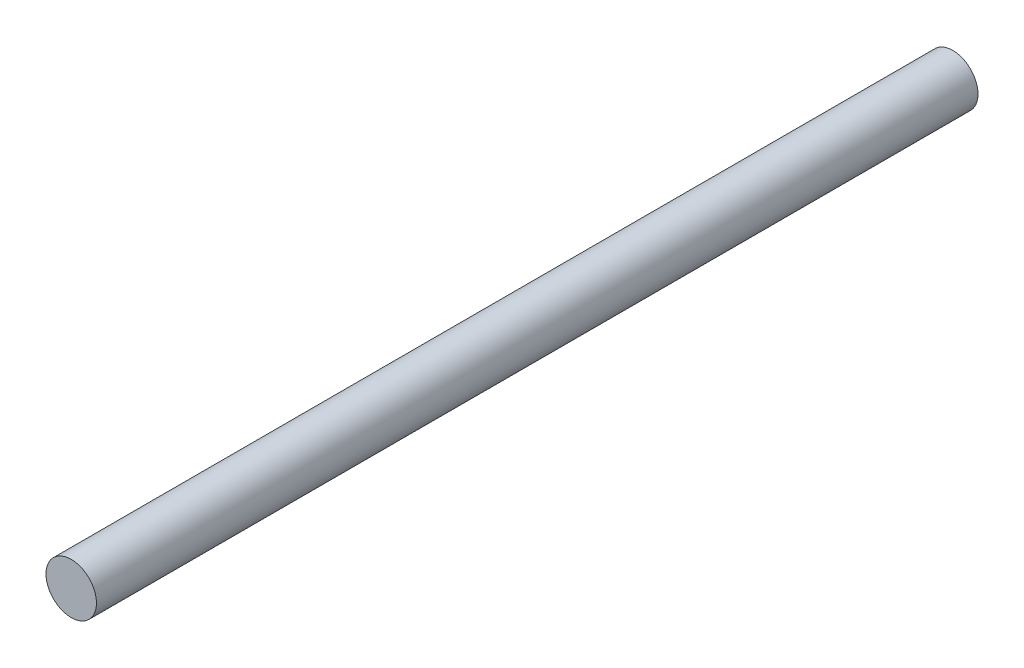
ISO-10303-21;
HEADER;
FILE_DESCRIPTION(('STEP AP214'),'2;1');
FILE_NAME('part.step','',(''),(''),'','','');
FILE_SCHEMA(('AUTOMOTIVE_DESIGN { 1 0 10303 214 1 1 1 1 }'));
ENDSEC;
DATA;
#1=APPLICATION_CONTEXT('core data for automotive mechanical design processes');
#2=APPLICATION_PROTOCOL_DEFINITION('international standard','automotive_design',2000,#1);
#3=PRODUCT_CONTEXT('',#1,'mechanical');
#4=PRODUCT('Part','Part','',(#3));
#5=PRODUCT_RELATED_PRODUCT_CATEGORY('part','',(#4));
#6=PRODUCT_DEFINITION_FORMATION('','',#4);
#7=PRODUCT_DEFINITION_CONTEXT('part definition',#1,'design');
#8=PRODUCT_DEFINITION('design','',#6,#7);
#9=PRODUCT_DEFINITION_SHAPE('','',#8);
#10=(LENGTH_UNIT() NAMED_UNIT(*) SI_UNIT(.MILLI.,.METRE.));
#11=(NAMED_UNIT(*) PLANE_ANGLE_UNIT() SI_UNIT($,.RADIAN.));
#12=(NAMED_UNIT(*) SI_UNIT($,.STERADIAN.) SOLID_ANGLE_UNIT());
#13=UNCERTAINTY_MEASURE_WITH_UNIT(LENGTH_MEASURE(1.E-05),#10,'distance_accuracy_value','');
#14=(GEOMETRIC_REPRESENTATION_CONTEXT(3) GLOBAL_UNCERTAINTY_ASSIGNED_CONTEXT((#13)) GLOBAL_UNIT_ASSIGNED_CONTEXT((#10,
#11,#12)) REPRESENTATION_CONTEXT('',''));
#15=CARTESIAN_POINT('',(0.,0.,0.));
#16=DIRECTION('',(0.,0.,1.));
#17=DIRECTION('',(1.,0.,0.));
#18=AXIS2_PLACEMENT_3D('',#15,#16,#17);
#19=CARTESIAN_POINT('',(0.,0.,524.));
#20=DIRECTION('',(0.,0.,1.));
#21=DIRECTION('',(0.,1.,0.));
#22=AXIS2_PLACEMENT_3D('',#19,#20,#21);
#23=PLANE('',#22);
#24=CARTESIAN_POINT('',(0.,0.,524.));
#25=DIRECTION('',(0.,0.,1.));
#26=DIRECTION('',(0.,1.,0.));
#27=AXIS2_PLACEMENT_3D('',#24,#25,#26);
#28=CIRCLE('',#27,15.);
#29=CARTESIAN_POINT('',(0.,15.,524.));
#30=VERTEX_POINT('',#29);
#31=EDGE_CURVE('E8',#30,#30,#28,.T.);
#32=ORIENTED_EDGE('',*,*,#31,.T.);
#33=EDGE_LOOP('',(#32));
#34=FACE_BOUND('',#33,.T.);
#35=ADVANCED_FACE('F12',(#34),#23,.T.);
#36=CARTESIAN_POINT('',(0.,0.,524.));
#37=DIRECTION('',(0.,0.,-1.));
#38=DIRECTION('',(0.,-1.,0.));
#39=AXIS2_PLACEMENT_3D('',#36,#37,#38);
#40=CYLINDRICAL_SURFACE('',#39,15.);
#41=ORIENTED_EDGE('',*,*,#31,.F.);
#42=EDGE_LOOP('',(#41));
#43=FACE_BOUND('',#42,.T.);
#44=CARTESIAN_POINT('',(0.,0.,0.));
#45=DIRECTION('',(0.,0.,1.));
#46=DIRECTION('',(0.,1.,0.));
#47=AXIS2_PLACEMENT_3D('',#44,#45,#46);
#48=CIRCLE('',#47,15.);
#49=CARTESIAN_POINT('',(0.,15.,0.));
#50=VERTEX_POINT('',#49);
#51=EDGE_CURVE('E16',#50,#50,#48,.T.);
#52=ORIENTED_EDGE('',*,*,#51,.T.);
#53=EDGE_LOOP('',(#52));
#54=FACE_BOUND('',#53,.T.);
#55=ADVANCED_FACE('F14',(#43,#54),#40,.T.);
#56=CARTESIAN_POINT('',(0.,0.,0.));
#57=DIRECTION('',(0.,0.,1.));
#58=DIRECTION('',(0.,1.,0.));
#59=AXIS2_PLACEMENT_3D('',#56,#57,#58);
#60=PLANE('',#59);
#61=ORIENTED_EDGE('',*,*,#51,.F.);
#62=EDGE_LOOP('',(#61));
#63=FACE_BOUND('',#62,.T.);
#64=ADVANCED_FACE('F26',(#63),#60,.F.);
#65=CLOSED_SHELL('',(#35,#55,#64));
#66=MANIFOLD_SOLID_BREP('B1',#65);
#67=ADVANCED_BREP_SHAPE_REPRESENTATION('',(#18,#66),#14);
#68=SHAPE_DEFINITION_REPRESENTATION(#9,#67);
ENDSEC;
END-ISO-10303-21;
